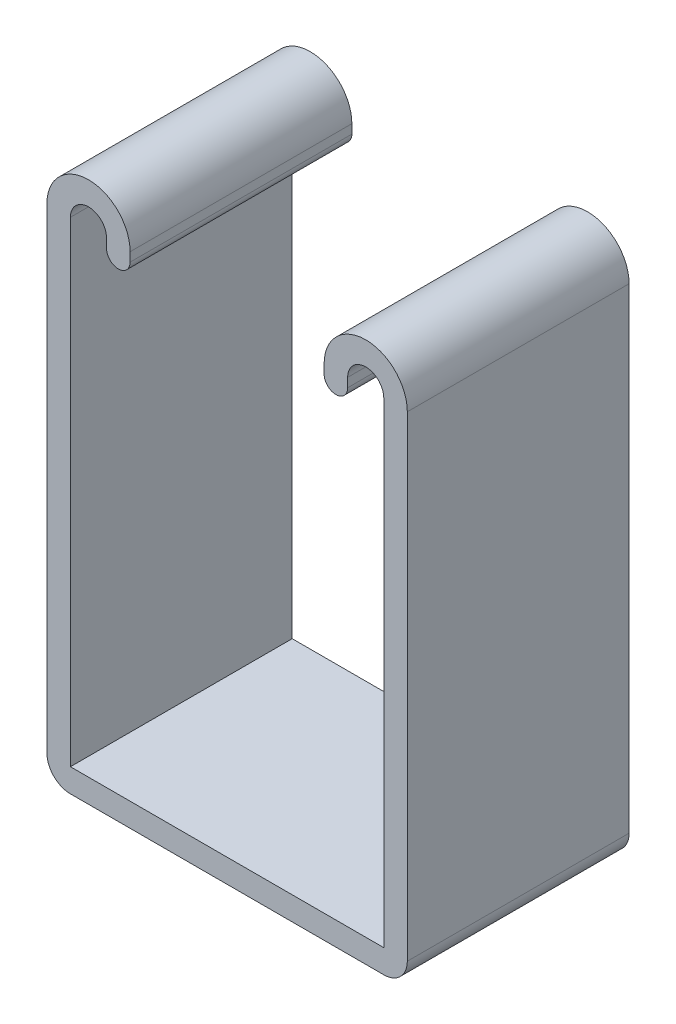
from build123d import *

# Parameters (mm, degrees)
BASE_EXTRUDE_DEPTH = 12.7


with BuildPart() as part:
    # Sketch1 → Base-Extrude (new, symmetric)
    with BuildSketch(Plane.XY):
        with BuildLine():
            Line((-20.6375, 29.1719), (-20.6375, -25.3238))
            ThreePointArc((-20.6375, -25.3238), (-19.848914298, -27.227614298), (-17.9451, -28.0162))
            Line((-17.9451, -28.0162), (17.9451, -28.0162))
            ThreePointArc((17.9451, -28.0162), (19.848914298, -27.227614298), (20.6375, -25.3238))
            Line((20.6375, -25.3238), (20.6375, 29.1719))
            ThreePointArc((20.6375, 29.1719), (15.875, 33.9344), (11.1125, 29.1719))
            Line((11.1125, 29.1719), (11.1125, 28.13685))
            ThreePointArc((11.1125, 28.13685), (12.4587, 26.79065), (13.8049, 28.13685))
            Line((13.8049, 28.13685), (13.8049, 29.1719))
            ThreePointArc((13.8049, 29.1719), (15.875, 31.242), (17.9451, 29.1719))
            Line((17.9451, 29.1719), (17.9451, -25.3238))
            Line((17.9451, -25.3238), (-17.9451, -25.3238))
            Line((-17.9451, -25.3238), (-17.9451, 29.1719))
            ThreePointArc((-17.9451, 29.1719), (-15.875, 31.242), (-13.8049, 29.1719))
            Line((-13.8049, 29.1719), (-13.8049, 28.13685))
            ThreePointArc((-13.8049, 28.13685), (-12.4587, 26.79065), (-11.1125, 28.13685))
            Line((-11.1125, 28.13685), (-11.1125, 29.1719))
            ThreePointArc((-11.1125, 29.1719), (-15.875, 33.9344), (-20.6375, 29.1719))
        make_face()
    extrude(amount=BASE_EXTRUDE_DEPTH, both=True)


solid = part.part
